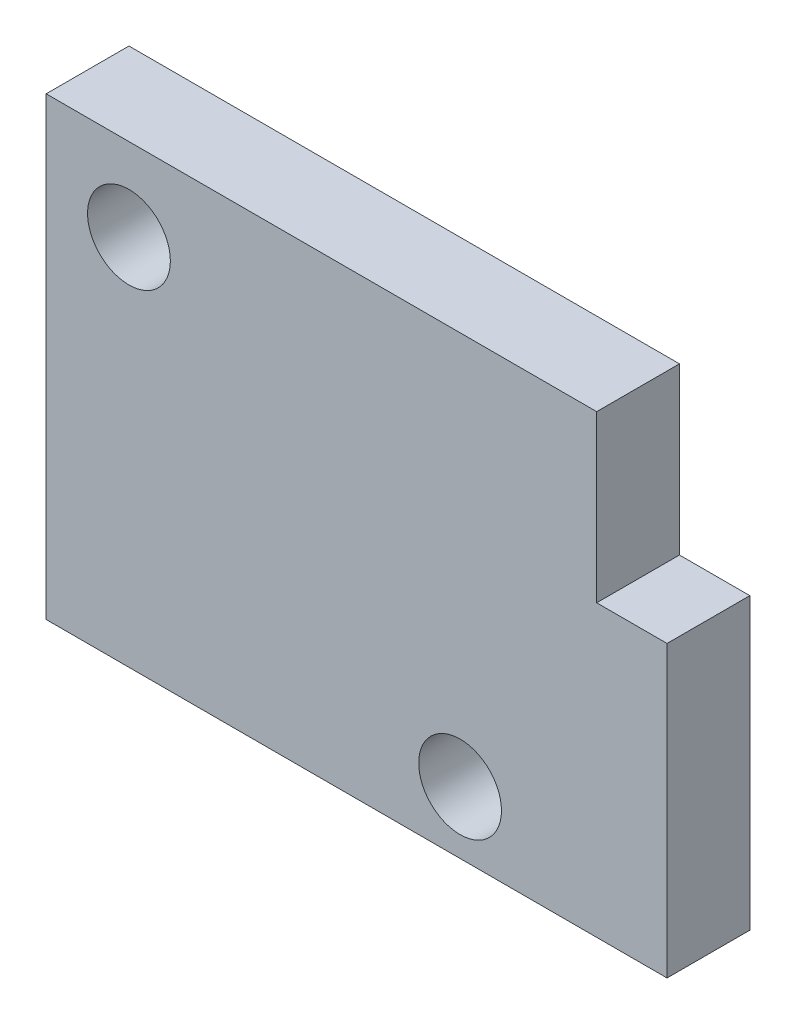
from build123d import *

# Parameters (mm, degrees)
SKETCH1_R           = 0.5
BOSS_EXTRUDE1_DEPTH = 1


with BuildPart() as part:
    # Sketch1 → Boss-Extrude1 (new body)
    with BuildSketch(Plane.XY):
        Polygon((3.151670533, 2.565441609), (3.151670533, 0.565441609), (4.001670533, 0.565441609), (4.001670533, -2.934558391), (-3.498329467, -2.934558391), (-3.498329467, 2.565441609), align=None)
        with Locations((-2.498329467, 1.565441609)):
            Circle(SKETCH1_R, mode=Mode.SUBTRACT)
        with Locations((1.501670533, -2.184558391)):
            Circle(SKETCH1_R, mode=Mode.SUBTRACT)
    extrude(amount=BOSS_EXTRUDE1_DEPTH)


solid = part.part
